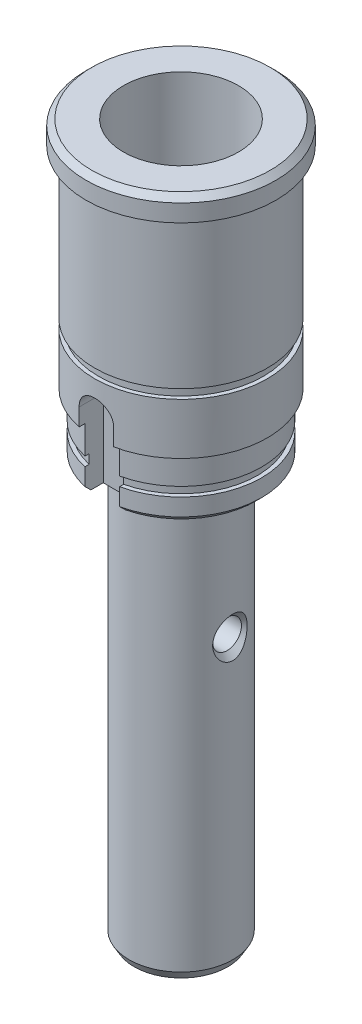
ISO-10303-21;
HEADER;
FILE_DESCRIPTION(('STEP AP214'),'2;1');
FILE_NAME('part.step','',(''),(''),'','','');
FILE_SCHEMA(('AUTOMOTIVE_DESIGN { 1 0 10303 214 1 1 1 1 }'));
ENDSEC;
DATA;
#1=APPLICATION_CONTEXT('core data for automotive mechanical design processes');
#2=APPLICATION_PROTOCOL_DEFINITION('international standard','automotive_design',2000,#1);
#3=PRODUCT_CONTEXT('',#1,'mechanical');
#4=PRODUCT('Part','Part','',(#3));
#5=PRODUCT_RELATED_PRODUCT_CATEGORY('part','',(#4));
#6=PRODUCT_DEFINITION_FORMATION('','',#4);
#7=PRODUCT_DEFINITION_CONTEXT('part definition',#1,'design');
#8=PRODUCT_DEFINITION('design','',#6,#7);
#9=PRODUCT_DEFINITION_SHAPE('','',#8);
#10=(LENGTH_UNIT() NAMED_UNIT(*) SI_UNIT(.MILLI.,.METRE.));
#11=(NAMED_UNIT(*) PLANE_ANGLE_UNIT() SI_UNIT($,.RADIAN.));
#12=(NAMED_UNIT(*) SI_UNIT($,.STERADIAN.) SOLID_ANGLE_UNIT());
#13=UNCERTAINTY_MEASURE_WITH_UNIT(LENGTH_MEASURE(1.E-05),#10,'distance_accuracy_value','');
#14=(GEOMETRIC_REPRESENTATION_CONTEXT(3) GLOBAL_UNCERTAINTY_ASSIGNED_CONTEXT((#13)) GLOBAL_UNIT_ASSIGNED_CONTEXT((#10,
#11,#12)) REPRESENTATION_CONTEXT('',''));
#15=CARTESIAN_POINT('',(0.,0.,0.));
#16=DIRECTION('',(0.,0.,1.));
#17=DIRECTION('',(1.,0.,0.));
#18=AXIS2_PLACEMENT_3D('',#15,#16,#17);
#19=CARTESIAN_POINT('',(14.,-51.,0.));
#20=DIRECTION('',(0.,1.,0.));
#21=DIRECTION('',(0.,0.,1.));
#22=AXIS2_PLACEMENT_3D('',#19,#20,#21);
#23=PLANE('',#22);
#24=CARTESIAN_POINT('',(0.,-51.,0.));
#25=DIRECTION('',(0.,1.,0.));
#26=DIRECTION('',(0.,0.,1.));
#27=AXIS2_PLACEMENT_3D('',#24,#25,#26);
#28=CIRCLE('',#27,10.);
#29=CARTESIAN_POINT('',(0.,-51.,10.));
#30=VERTEX_POINT('',#29);
#31=EDGE_CURVE('E237',#30,#30,#28,.T.);
#32=ORIENTED_EDGE('',*,*,#31,.T.);
#33=EDGE_LOOP('',(#32));
#34=FACE_BOUND('',#33,.T.);
#35=DIRECTION('',(0.,0.,-1.));
#36=VECTOR('',#35,1.);
#37=CARTESIAN_POINT('',(-3.,-51.,0.));
#38=LINE('',#37,#36);
#39=CARTESIAN_POINT('',(-3.,-51.,12.6491106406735));
#40=VERTEX_POINT('',#39);
#41=CARTESIAN_POINT('',(-3.,-51.,10.5));
#42=VERTEX_POINT('',#41);
#43=EDGE_CURVE('E176',#40,#42,#38,.T.);
#44=ORIENTED_EDGE('',*,*,#43,.F.);
#45=CARTESIAN_POINT('',(0.,-51.,0.));
#46=DIRECTION('',(0.,1.,0.));
#47=DIRECTION('',(0.,0.,1.));
#48=AXIS2_PLACEMENT_3D('',#45,#46,#47);
#49=CIRCLE('',#48,13.);
#50=CARTESIAN_POINT('',(3.,-51.,12.6491106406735));
#51=VERTEX_POINT('',#50);
#52=EDGE_CURVE('E234',#40,#51,#49,.F.);
#53=ORIENTED_EDGE('',*,*,#52,.T.);
#54=DIRECTION('',(0.,0.,1.));
#55=VECTOR('',#54,1.);
#56=CARTESIAN_POINT('',(3.,-51.,0.));
#57=LINE('',#56,#55);
#58=CARTESIAN_POINT('',(3.,-51.,10.5));
#59=VERTEX_POINT('',#58);
#60=EDGE_CURVE('E54',#59,#51,#57,.T.);
#61=ORIENTED_EDGE('',*,*,#60,.F.);
#62=DIRECTION('',(1.,0.,0.));
#63=VECTOR('',#62,1.);
#64=CARTESIAN_POINT('',(14.,-51.,10.5));
#65=LINE('',#64,#63);
#66=EDGE_CURVE('E11',#42,#59,#65,.T.);
#67=ORIENTED_EDGE('',*,*,#66,.F.);
#68=EDGE_LOOP('',(#44,#53,#61,#67));
#69=FACE_BOUND('',#68,.T.);
#70=ADVANCED_FACE('F34',(#34,#69),#23,.F.);
#71=CARTESIAN_POINT('',(0.,9.98599402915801,0.));
#72=DIRECTION('',(0.,1.,0.));
#73=DIRECTION('',(0.,0.,1.));
#74=AXIS2_PLACEMENT_3D('',#71,#72,#73);
#75=CYLINDRICAL_SURFACE('',#74,14.);
#76=DIRECTION('',(0.,1.,0.));
#77=VECTOR('',#76,1.);
#78=CARTESIAN_POINT('',(-2.99999999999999,9.98599402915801,13.6747943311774));
#79=LINE('',#78,#77);
#80=CARTESIAN_POINT('',(-2.99999999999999,-47.,13.6747943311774));
#81=VERTEX_POINT('',#80);
#82=CARTESIAN_POINT('',(-3.,-50.,13.6747943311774));
#83=VERTEX_POINT('',#82);
#84=EDGE_CURVE('E174',#81,#83,#79,.F.);
#85=ORIENTED_EDGE('',*,*,#84,.F.);
#86=CARTESIAN_POINT('',(0.,-47.,0.));
#87=DIRECTION('',(0.,1.,0.));
#88=DIRECTION('',(0.,0.,1.));
#89=AXIS2_PLACEMENT_3D('',#86,#87,#88);
#90=CIRCLE('',#89,14.);
#91=CARTESIAN_POINT('',(3.,-47.,13.6747943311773));
#92=VERTEX_POINT('',#91);
#93=EDGE_CURVE('E219',#92,#81,#90,.T.);
#94=ORIENTED_EDGE('',*,*,#93,.F.);
#95=DIRECTION('',(0.,1.,0.));
#96=VECTOR('',#95,1.);
#97=CARTESIAN_POINT('',(3.,9.98599402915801,13.6747943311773));
#98=LINE('',#97,#96);
#99=CARTESIAN_POINT('',(3.,-50.,13.6747943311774));
#100=VERTEX_POINT('',#99);
#101=EDGE_CURVE('E159',#100,#92,#98,.T.);
#102=ORIENTED_EDGE('',*,*,#101,.F.);
#103=CARTESIAN_POINT('',(0.,-50.,0.));
#104=DIRECTION('',(0.,1.,0.));
#105=DIRECTION('',(0.,0.,1.));
#106=AXIS2_PLACEMENT_3D('',#103,#104,#105);
#107=CIRCLE('',#106,14.);
#108=EDGE_CURVE('E249',#100,#83,#107,.T.);
#109=ORIENTED_EDGE('',*,*,#108,.T.);
#110=EDGE_LOOP('',(#85,#94,#102,#109));
#111=FACE_BOUND('',#110,.T.);
#112=ADVANCED_FACE('F313',(#111),#75,.T.);
#113=CARTESIAN_POINT('',(14.,-47.,0.));
#114=DIRECTION('',(0.,-1.,0.));
#115=DIRECTION('',(0.,0.,-1.));
#116=AXIS2_PLACEMENT_3D('',#113,#114,#115);
#117=PLANE('',#116);
#118=DIRECTION('',(0.,0.,1.));
#119=VECTOR('',#118,1.);
#120=CARTESIAN_POINT('',(-3.,-47.,0.));
#121=LINE('',#120,#119);
#122=CARTESIAN_POINT('',(-3.,-47.,12.9572373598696));
#123=VERTEX_POINT('',#122);
#124=EDGE_CURVE('E178',#123,#81,#121,.T.);
#125=ORIENTED_EDGE('',*,*,#124,.F.);
#126=CARTESIAN_POINT('',(0.,-47.,0.));
#127=DIRECTION('',(0.,1.,0.));
#128=DIRECTION('',(0.,0.,1.));
#129=AXIS2_PLACEMENT_3D('',#126,#127,#128);
#130=CIRCLE('',#129,13.3);
#131=CARTESIAN_POINT('',(3.,-47.,12.9572373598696));
#132=VERTEX_POINT('',#131);
#133=EDGE_CURVE('E216',#132,#123,#130,.T.);
#134=ORIENTED_EDGE('',*,*,#133,.F.);
#135=DIRECTION('',(0.,0.,-1.));
#136=VECTOR('',#135,1.);
#137=CARTESIAN_POINT('',(3.,-47.,0.));
#138=LINE('',#137,#136);
#139=EDGE_CURVE('E162',#92,#132,#138,.T.);
#140=ORIENTED_EDGE('',*,*,#139,.F.);
#141=ORIENTED_EDGE('',*,*,#93,.T.);
#142=EDGE_LOOP('',(#125,#134,#140,#141));
#143=FACE_BOUND('',#142,.T.);
#144=ADVANCED_FACE('F309',(#143),#117,.F.);
#145=CARTESIAN_POINT('',(0.,9.98599402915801,0.));
#146=DIRECTION('',(0.,1.,0.));
#147=DIRECTION('',(0.,0.,1.));
#148=AXIS2_PLACEMENT_3D('',#145,#146,#147);
#149=CYLINDRICAL_SURFACE('',#148,13.3);
#150=DIRECTION('',(0.,1.,0.));
#151=VECTOR('',#150,1.);
#152=CARTESIAN_POINT('',(-2.99999999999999,9.98599402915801,12.9572373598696));
#153=LINE('',#152,#151);
#154=CARTESIAN_POINT('',(-2.99999999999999,-45.4,12.9572373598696));
#155=VERTEX_POINT('',#154);
#156=EDGE_CURVE('E180',#155,#123,#153,.F.);
#157=ORIENTED_EDGE('',*,*,#156,.F.);
#158=CARTESIAN_POINT('',(0.,-45.4,0.));
#159=DIRECTION('',(0.,1.,0.));
#160=DIRECTION('',(0.,0.,1.));
#161=AXIS2_PLACEMENT_3D('',#158,#159,#160);
#162=CIRCLE('',#161,13.3);
#163=CARTESIAN_POINT('',(3.,-45.4,12.9572373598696));
#164=VERTEX_POINT('',#163);
#165=EDGE_CURVE('E213',#164,#155,#162,.T.);
#166=ORIENTED_EDGE('',*,*,#165,.F.);
#167=DIRECTION('',(0.,1.,0.));
#168=VECTOR('',#167,1.);
#169=CARTESIAN_POINT('',(3.,9.98599402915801,12.9572373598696));
#170=LINE('',#169,#168);
#171=EDGE_CURVE('E164',#132,#164,#170,.T.);
#172=ORIENTED_EDGE('',*,*,#171,.F.);
#173=ORIENTED_EDGE('',*,*,#133,.T.);
#174=EDGE_LOOP('',(#157,#166,#172,#173));
#175=FACE_BOUND('',#174,.T.);
#176=ADVANCED_FACE('F305',(#175),#149,.T.);
#177=CARTESIAN_POINT('',(13.3,-45.4,0.));
#178=DIRECTION('',(0.,1.,0.));
#179=DIRECTION('',(0.,0.,1.));
#180=AXIS2_PLACEMENT_3D('',#177,#178,#179);
#181=PLANE('',#180);
#182=DIRECTION('',(0.,0.,-1.));
#183=VECTOR('',#182,1.);
#184=CARTESIAN_POINT('',(-3.,-45.4,0.));
#185=LINE('',#184,#183);
#186=CARTESIAN_POINT('',(-3.,-45.4,13.6747943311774));
#187=VERTEX_POINT('',#186);
#188=EDGE_CURVE('E182',#187,#155,#185,.T.);
#189=ORIENTED_EDGE('',*,*,#188,.F.);
#190=CARTESIAN_POINT('',(0.,-45.4,0.));
#191=DIRECTION('',(0.,1.,0.));
#192=DIRECTION('',(0.,0.,1.));
#193=AXIS2_PLACEMENT_3D('',#190,#191,#192);
#194=CIRCLE('',#193,14.);
#195=CARTESIAN_POINT('',(3.,-45.4,13.6747943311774));
#196=VERTEX_POINT('',#195);
#197=EDGE_CURVE('E210',#196,#187,#194,.T.);
#198=ORIENTED_EDGE('',*,*,#197,.F.);
#199=DIRECTION('',(0.,0.,1.));
#200=VECTOR('',#199,1.);
#201=CARTESIAN_POINT('',(3.,-45.4,0.));
#202=LINE('',#201,#200);
#203=EDGE_CURVE('E166',#164,#196,#202,.T.);
#204=ORIENTED_EDGE('',*,*,#203,.F.);
#205=ORIENTED_EDGE('',*,*,#165,.T.);
#206=EDGE_LOOP('',(#189,#198,#204,#205));
#207=FACE_BOUND('',#206,.T.);
#208=ADVANCED_FACE('F301',(#207),#181,.F.);
#209=CARTESIAN_POINT('',(0.,9.98599402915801,0.));
#210=DIRECTION('',(0.,1.,0.));
#211=DIRECTION('',(0.,0.,1.));
#212=AXIS2_PLACEMENT_3D('',#209,#210,#211);
#213=CYLINDRICAL_SURFACE('',#212,14.);
#214=DIRECTION('',(0.,1.,0.));
#215=VECTOR('',#214,1.);
#216=CARTESIAN_POINT('',(-2.99999999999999,9.98599402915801,13.6747943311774));
#217=LINE('',#216,#215);
#218=CARTESIAN_POINT('',(-2.99999999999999,-40.5,13.6747943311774));
#219=VERTEX_POINT('',#218);
#220=EDGE_CURVE('E184',#219,#187,#217,.F.);
#221=ORIENTED_EDGE('',*,*,#220,.F.);
#222=CARTESIAN_POINT('',(0.,-40.5,0.));
#223=DIRECTION('',(0.,1.,0.));
#224=DIRECTION('',(0.,0.,1.));
#225=AXIS2_PLACEMENT_3D('',#222,#223,#224);
#226=CIRCLE('',#225,14.);
#227=CARTESIAN_POINT('',(3.,-40.5,13.6747943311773));
#228=VERTEX_POINT('',#227);
#229=EDGE_CURVE('E207',#228,#219,#226,.T.);
#230=ORIENTED_EDGE('',*,*,#229,.F.);
#231=DIRECTION('',(0.,1.,0.));
#232=VECTOR('',#231,1.);
#233=CARTESIAN_POINT('',(3.,9.98599402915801,13.6747943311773));
#234=LINE('',#233,#232);
#235=EDGE_CURVE('E168',#196,#228,#234,.T.);
#236=ORIENTED_EDGE('',*,*,#235,.F.);
#237=ORIENTED_EDGE('',*,*,#197,.T.);
#238=EDGE_LOOP('',(#221,#230,#236,#237));
#239=FACE_BOUND('',#238,.T.);
#240=ADVANCED_FACE('F297',(#239),#213,.T.);
#241=CARTESIAN_POINT('',(15.,-40.5,0.));
#242=DIRECTION('',(0.,1.,0.));
#243=DIRECTION('',(0.,0.,1.));
#244=AXIS2_PLACEMENT_3D('',#241,#242,#243);
#245=PLANE('',#244);
#246=DIRECTION('',(0.,0.,-1.));
#247=VECTOR('',#246,1.);
#248=CARTESIAN_POINT('',(-3.,-40.5,0.));
#249=LINE('',#248,#247);
#250=CARTESIAN_POINT('',(-3.,-40.5,14.6969384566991));
#251=VERTEX_POINT('',#250);
#252=EDGE_CURVE('E186',#251,#219,#249,.T.);
#253=ORIENTED_EDGE('',*,*,#252,.F.);
#254=CARTESIAN_POINT('',(0.,-40.5,0.));
#255=DIRECTION('',(0.,1.,0.));
#256=DIRECTION('',(0.,0.,1.));
#257=AXIS2_PLACEMENT_3D('',#254,#255,#256);
#258=CIRCLE('',#257,15.);
#259=CARTESIAN_POINT('',(3.,-40.5,14.6969384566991));
#260=VERTEX_POINT('',#259);
#261=EDGE_CURVE('E204',#260,#251,#258,.T.);
#262=ORIENTED_EDGE('',*,*,#261,.F.);
#263=DIRECTION('',(0.,0.,1.));
#264=VECTOR('',#263,1.);
#265=CARTESIAN_POINT('',(3.,-40.5,0.));
#266=LINE('',#265,#264);
#267=EDGE_CURVE('E170',#228,#260,#266,.T.);
#268=ORIENTED_EDGE('',*,*,#267,.F.);
#269=ORIENTED_EDGE('',*,*,#229,.T.);
#270=EDGE_LOOP('',(#253,#262,#268,#269));
#271=FACE_BOUND('',#270,.T.);
#272=ADVANCED_FACE('F291',(#271),#245,.F.);
#273=CARTESIAN_POINT('',(0.,9.98599402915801,0.));
#274=DIRECTION('',(0.,1.,0.));
#275=DIRECTION('',(0.,0.,1.));
#276=AXIS2_PLACEMENT_3D('',#273,#274,#275);
#277=CYLINDRICAL_SURFACE('',#276,15.);
#278=CARTESIAN_POINT('',(0.,-31.6,0.));
#279=DIRECTION('',(0.,1.,0.));
#280=DIRECTION('',(0.,0.,1.));
#281=AXIS2_PLACEMENT_3D('',#278,#279,#280);
#282=CIRCLE('',#281,15.);
#283=CARTESIAN_POINT('',(0.,-31.6,15.));
#284=VERTEX_POINT('',#283);
#285=EDGE_CURVE('E201',#284,#284,#282,.T.);
#286=ORIENTED_EDGE('',*,*,#285,.F.);
#287=EDGE_LOOP('',(#286));
#288=FACE_BOUND('',#287,.T.);
#289=DIRECTION('',(0.,1.,0.));
#290=VECTOR('',#289,1.);
#291=CARTESIAN_POINT('',(-2.99999999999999,9.98599402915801,14.6969384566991));
#292=LINE('',#291,#290);
#293=CARTESIAN_POINT('',(-3.,-37.5,14.6969384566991));
#294=VERTEX_POINT('',#293);
#295=EDGE_CURVE('E62',#294,#251,#292,.F.);
#296=ORIENTED_EDGE('',*,*,#295,.F.);
#297=CARTESIAN_POINT('',(3.,-37.5,14.6969384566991));
#298=CARTESIAN_POINT('',(3.0000090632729,-37.4165231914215,14.6969312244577));
#299=CARTESIAN_POINT('',(2.99651591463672,-37.3330513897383,14.6976495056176));
#300=CARTESIAN_POINT('',(2.98259549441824,-37.1667219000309,14.7004835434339));
#301=CARTESIAN_POINT('',(2.97216908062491,-37.0838641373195,14.7025991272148));
#302=CARTESIAN_POINT('',(2.94447346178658,-36.9194709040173,14.708170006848));
#303=CARTESIAN_POINT('',(2.92721468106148,-36.8379336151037,14.7116232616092));
#304=CARTESIAN_POINT('',(2.88600721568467,-36.6766535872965,14.7197622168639));
#305=CARTESIAN_POINT('',(2.86205850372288,-36.5969108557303,14.7244479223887));
#306=CARTESIAN_POINT('',(2.78041527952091,-36.361194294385,14.7401631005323));
#307=CARTESIAN_POINT('',(2.71290158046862,-36.2086019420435,14.7528553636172));
#308=CARTESIAN_POINT('',(2.55375565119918,-35.9169726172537,14.7812320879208));
#309=CARTESIAN_POINT('',(2.46212092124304,-35.7779370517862,14.7969168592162));
#310=CARTESIAN_POINT('',(2.25594334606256,-35.5153294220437,14.829758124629));
#311=CARTESIAN_POINT('',(2.14112719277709,-35.391973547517,14.8469306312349));
#312=CARTESIAN_POINT('',(1.89243128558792,-35.1661342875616,14.8806728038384));
#313=CARTESIAN_POINT('',(1.75854858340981,-35.0636541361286,14.8972423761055));
#314=CARTESIAN_POINT('',(1.47408029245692,-34.8816339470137,14.9280843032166));
#315=CARTESIAN_POINT('',(1.32335950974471,-34.8023012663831,14.9423354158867));
#316=CARTESIAN_POINT('',(1.01040357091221,-34.6701721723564,14.9667526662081));
#317=CARTESIAN_POINT('',(0.848170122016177,-34.6173718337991,14.9769194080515));
#318=CARTESIAN_POINT('',(0.519052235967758,-34.5404789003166,14.9919095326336));
#319=CARTESIAN_POINT('',(0.352257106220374,-34.5160176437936,14.996801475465));
#320=CARTESIAN_POINT('',(0.0168596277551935,-34.4953470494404,15.0009276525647));
#321=CARTESIAN_POINT('',(-0.151742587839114,-34.4991356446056,15.0001623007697));
#322=CARTESIAN_POINT('',(-0.483426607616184,-34.5345786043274,14.9931130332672));
#323=CARTESIAN_POINT('',(-0.646552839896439,-34.5658351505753,14.9869079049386));
#324=CARTESIAN_POINT('',(-0.965196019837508,-34.6546955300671,14.9697652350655));
#325=CARTESIAN_POINT('',(-1.12071271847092,-34.7123002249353,14.9588275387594));
#326=CARTESIAN_POINT('',(-1.42086081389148,-34.8525912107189,14.9333186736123));
#327=CARTESIAN_POINT('',(-1.56541718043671,-34.9354337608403,14.918724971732));
#328=CARTESIAN_POINT('',(-1.83871931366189,-35.1237308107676,14.8875135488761));
#329=CARTESIAN_POINT('',(-1.96746376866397,-35.2291871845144,14.8708956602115));
#330=CARTESIAN_POINT('',(-2.20783861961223,-35.4618850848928,14.8371311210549));
#331=CARTESIAN_POINT('',(-2.31913408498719,-35.5894722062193,14.8199802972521));
#332=CARTESIAN_POINT('',(-2.51883269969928,-35.861714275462,14.7873511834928));
#333=CARTESIAN_POINT('',(-2.60722950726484,-36.0063739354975,14.7718733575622));
#334=CARTESIAN_POINT('',(-2.75873986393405,-36.309157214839,14.7443319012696));
#335=CARTESIAN_POINT('',(-2.82178462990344,-36.46731607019,14.7322775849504));
#336=CARTESIAN_POINT('',(-2.9202212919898,-36.7921758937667,14.7130848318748));
#337=CARTESIAN_POINT('',(-2.95565438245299,-36.9588637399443,14.7059390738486));
#338=CARTESIAN_POINT('',(-2.9844988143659,-37.1890704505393,14.7000953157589));
#339=CARTESIAN_POINT('',(-2.99031376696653,-37.2511624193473,14.6989127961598));
#340=CARTESIAN_POINT('',(-2.99805949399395,-37.3754935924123,14.6973350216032));
#341=CARTESIAN_POINT('',(-2.99999676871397,-37.4377323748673,14.6969384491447));
#342=CARTESIAN_POINT('',(-3.,-37.5,14.6969384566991));
#343=B_SPLINE_CURVE_WITH_KNOTS('',3,(#297,#298,#299,#300,#301,#302,#303,#304,#305,#306,#307,
#308,#309,#310,#311,#312,#313,#314,#315,#316,#317,#318,#319,#320,#321,#322,#323,#324,#325,#326,
#327,#328,#329,#330,#331,#332,#333,#334,#335,#336,#337,#338,#339,#340,#341,#342),.UNSPECIFIED.,
.F.,.F.,(4,2,2,2,2,2,2,2,2,2,2,2,2,2,2,2,2,2,2,2,2,2,4),(0.,0.250345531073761,0.500660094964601,
0.750594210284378,1.00052934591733,1.5000082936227,1.99953902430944,2.50534477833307,
3.01122883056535,3.52151451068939,4.03172467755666,4.5352202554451,5.03867899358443,
5.53496413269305,6.03126550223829,6.53070440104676,7.03018470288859,7.53831354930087,
8.04658297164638,8.5562222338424,9.06509969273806,9.25212746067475,9.43884144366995),.UNSPECIFIED.);
#344=CARTESIAN_POINT('',(3.,-37.5,14.6969384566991));
#345=VERTEX_POINT('',#344);
#346=EDGE_CURVE('E46',#345,#294,#343,.T.);
#347=ORIENTED_EDGE('',*,*,#346,.F.);
#348=DIRECTION('',(0.,1.,0.));
#349=VECTOR('',#348,1.);
#350=CARTESIAN_POINT('',(3.,9.98599402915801,14.6969384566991));
#351=LINE('',#350,#349);
#352=EDGE_CURVE('E172',#260,#345,#351,.T.);
#353=ORIENTED_EDGE('',*,*,#352,.F.);
#354=ORIENTED_EDGE('',*,*,#261,.T.);
#355=EDGE_LOOP('',(#296,#347,#353,#354));
#356=FACE_BOUND('',#355,.T.);
#357=ADVANCED_FACE('F286',(#288,#356),#277,.T.);
#358=CARTESIAN_POINT('',(0.,-50.,0.));
#359=DIRECTION('',(0.,1.,0.));
#360=DIRECTION('',(0.,0.,1.));
#361=AXIS2_PLACEMENT_3D('',#358,#359,#360);
#362=CONICAL_SURFACE('',#361,14.,0.785398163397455);
#363=ORIENTED_EDGE('',*,*,#52,.F.);
#364=CARTESIAN_POINT('',(-3.,-55.5667533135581,7.88160197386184));
#365=CARTESIAN_POINT('',(-3.,-55.3682053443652,8.09402792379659));
#366=CARTESIAN_POINT('',(-3.,-55.1691349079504,8.30596402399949));
#367=CARTESIAN_POINT('',(-3.,-54.7701226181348,8.72901231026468));
#368=CARTESIAN_POINT('',(-3.,-54.5701807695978,8.94012450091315));
#369=CARTESIAN_POINT('',(-3.,-54.1696004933,9.36167939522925));
#370=CARTESIAN_POINT('',(-3.,-53.968962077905,9.57212211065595));
#371=CARTESIAN_POINT('',(-3.,-53.5671042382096,9.99245255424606));
#372=CARTESIAN_POINT('',(-3.,-53.365884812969,10.2023402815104));
#373=CARTESIAN_POINT('',(-3.,-52.7615206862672,10.8312950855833));
#374=CARTESIAN_POINT('',(-3.,-52.3576551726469,11.2496694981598));
#375=CARTESIAN_POINT('',(-3.,-51.5485492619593,12.085089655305));
#376=CARTESIAN_POINT('',(-3.,-51.1433088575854,12.5021353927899));
#377=CARTESIAN_POINT('',(-3.,-50.3318216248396,13.3352155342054));
#378=CARTESIAN_POINT('',(-3.,-49.9255748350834,13.7512499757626));
#379=CARTESIAN_POINT('',(-3.,-49.1123018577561,14.582556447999));
#380=CARTESIAN_POINT('',(-3.,-48.7052756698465,14.997828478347));
#381=CARTESIAN_POINT('',(-3.,-47.8906034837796,15.8277908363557));
#382=CARTESIAN_POINT('',(-3.,-47.4829574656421,16.242481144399));
#383=CARTESIAN_POINT('',(-3.,-46.667176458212,17.0713813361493));
#384=CARTESIAN_POINT('',(-3.,-46.2590414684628,17.4855912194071));
#385=CARTESIAN_POINT('',(-3.,-45.8507211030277,17.8996179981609));
#386=B_SPLINE_CURVE_WITH_KNOTS('',3,(#364,#365,#366,#367,#368,#369,#370,#371,#372,#373,#374,
#375,#376,#377,#378,#379,#380,#381,#382,#383,#384,#385),.UNSPECIFIED.,.F.,.F.,(4,2,2,2,2,2,2,2,
2,2,4),(0.,0.872301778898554,1.74459869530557,2.61688020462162,3.48916312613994,
5.23366387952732,6.97817391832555,8.72261802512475,10.4670628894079,12.2115652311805,
13.9560692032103),.UNSPECIFIED.);
#387=EDGE_CURVE('E259',#40,#83,#386,.T.);
#388=ORIENTED_EDGE('',*,*,#387,.T.);
#389=ORIENTED_EDGE('',*,*,#108,.F.);
#390=CARTESIAN_POINT('',(3.,-45.8507211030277,17.8996179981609));
#391=CARTESIAN_POINT('',(3.,-46.2590414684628,17.4855912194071));
#392=CARTESIAN_POINT('',(3.,-46.667176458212,17.0713813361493));
#393=CARTESIAN_POINT('',(3.,-47.4829574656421,16.242481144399));
#394=CARTESIAN_POINT('',(3.,-47.8906034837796,15.8277908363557));
#395=CARTESIAN_POINT('',(3.,-48.7052756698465,14.997828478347));
#396=CARTESIAN_POINT('',(3.,-49.1123018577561,14.582556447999));
#397=CARTESIAN_POINT('',(3.,-49.9255748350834,13.7512499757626));
#398=CARTESIAN_POINT('',(3.,-50.3318216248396,13.3352155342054));
#399=CARTESIAN_POINT('',(3.,-51.1433088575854,12.5021353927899));
#400=CARTESIAN_POINT('',(3.,-51.5485492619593,12.085089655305));
#401=CARTESIAN_POINT('',(3.,-52.3576551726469,11.2496694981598));
#402=CARTESIAN_POINT('',(3.,-52.7615206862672,10.8312950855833));
#403=CARTESIAN_POINT('',(3.,-53.365884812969,10.2023402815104));
#404=CARTESIAN_POINT('',(3.,-53.5671042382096,9.99245255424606));
#405=CARTESIAN_POINT('',(3.,-53.968962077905,9.57212211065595));
#406=CARTESIAN_POINT('',(3.,-54.1696004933,9.36167939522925));
#407=CARTESIAN_POINT('',(3.,-54.5701807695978,8.94012450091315));
#408=CARTESIAN_POINT('',(3.,-54.7701226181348,8.72901231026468));
#409=CARTESIAN_POINT('',(3.,-55.1691349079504,8.3059640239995));
#410=CARTESIAN_POINT('',(3.,-55.3682053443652,8.0940279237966));
#411=CARTESIAN_POINT('',(3.,-55.5667533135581,7.88160197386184));
#412=B_SPLINE_CURVE_WITH_KNOTS('',3,(#390,#391,#392,#393,#394,#395,#396,#397,#398,#399,#400,
#401,#402,#403,#404,#405,#406,#407,#408,#409,#410,#411),.UNSPECIFIED.,.F.,.F.,(4,2,2,2,2,2,2,2,
2,2,4),(0.,1.7445039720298,3.48900631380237,5.23345117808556,6.97789528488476,8.72240532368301,
10.4669060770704,11.3391889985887,12.2114705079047,13.0837674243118,13.9560692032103),.UNSPECIFIED.);
#413=EDGE_CURVE('E252',#100,#51,#412,.T.);
#414=ORIENTED_EDGE('',*,*,#413,.T.);
#415=EDGE_LOOP('',(#363,#388,#389,#414));
#416=FACE_BOUND('',#415,.T.);
#417=ADVANCED_FACE('F265',(#416),#362,.T.);
#418=CARTESIAN_POINT('',(9.00000000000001,-123.5,0.));
#419=DIRECTION('',(0.,1.,0.));
#420=DIRECTION('',(0.,0.,1.));
#421=AXIS2_PLACEMENT_3D('',#418,#419,#420);
#422=PLANE('',#421);
#423=CARTESIAN_POINT('',(0.,-123.5,0.));
#424=DIRECTION('',(0.,1.,0.));
#425=DIRECTION('',(0.,0.,1.));
#426=AXIS2_PLACEMENT_3D('',#423,#424,#425);
#427=CIRCLE('',#426,8.13397459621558);
#428=CARTESIAN_POINT('',(0.,-123.5,8.13397459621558));
#429=VERTEX_POINT('',#428);
#430=EDGE_CURVE('E231',#429,#429,#427,.F.);
#431=ORIENTED_EDGE('',*,*,#430,.T.);
#432=EDGE_LOOP('',(#431));
#433=FACE_BOUND('',#432,.T.);
#434=ADVANCED_FACE('F36',(#433),#422,.F.);
#435=CARTESIAN_POINT('',(0.,9.98599402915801,0.));
#436=DIRECTION('',(0.,1.,0.));
#437=DIRECTION('',(0.,0.,1.));
#438=AXIS2_PLACEMENT_3D('',#435,#436,#437);
#439=CYLINDRICAL_SURFACE('',#438,9.00000000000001);
#440=CARTESIAN_POINT('',(-8.61271600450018,-75.193480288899,-2.61172828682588));
#441=CARTESIAN_POINT('',(-8.58526522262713,-75.0033823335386,-2.70226424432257));
#442=CARTESIAN_POINT('',(-8.56107579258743,-74.8049321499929,-2.77700005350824));
#443=CARTESIAN_POINT('',(-8.52232226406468,-74.3973896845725,-2.89375924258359));
#444=CARTESIAN_POINT('',(-8.5077827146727,-74.1882717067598,-2.9356992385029));
#445=CARTESIAN_POINT('',(-8.49024477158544,-73.7652858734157,-2.98604557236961));
#446=CARTESIAN_POINT('',(-8.48725868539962,-73.5514131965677,-2.99441615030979));
#447=CARTESIAN_POINT('',(-8.4932571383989,-73.1253421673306,-2.97735765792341));
#448=CARTESIAN_POINT('',(-8.50223394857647,-72.9131428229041,-2.9519504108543));
#449=CARTESIAN_POINT('',(-8.53106344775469,-72.495034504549,-2.86756672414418));
#450=CARTESIAN_POINT('',(-8.55097704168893,-72.2891676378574,-2.80840222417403));
#451=CARTESIAN_POINT('',(-8.59919239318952,-71.8907444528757,-2.65709759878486));
#452=CARTESIAN_POINT('',(-8.62750064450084,-71.6981985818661,-2.56493193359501));
#453=CARTESIAN_POINT('',(-8.68858750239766,-71.3344496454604,-2.34964765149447));
#454=CARTESIAN_POINT('',(-8.7213217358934,-71.1630635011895,-2.22682715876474));
#455=CARTESIAN_POINT('',(-8.78708967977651,-70.8465568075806,-1.95115442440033));
#456=CARTESIAN_POINT('',(-8.82012276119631,-70.7013905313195,-1.79835545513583));
#457=CARTESIAN_POINT('',(-8.87323202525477,-70.4799477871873,-1.51031150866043));
#458=CARTESIAN_POINT('',(-8.89440226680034,-70.3956463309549,-1.38141514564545));
#459=CARTESIAN_POINT('',(-8.93219931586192,-70.249024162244,-1.11102865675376));
#460=CARTESIAN_POINT('',(-8.94882983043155,-70.1866855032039,-0.969548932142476));
#461=CARTESIAN_POINT('',(-8.97576492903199,-70.0871632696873,-0.676325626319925));
#462=CARTESIAN_POINT('',(-8.98602921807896,-70.0501397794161,-0.524523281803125));
#463=CARTESIAN_POINT('',(-8.99871612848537,-70.004521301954,-0.216378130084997));
#464=CARTESIAN_POINT('',(-9.001142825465,-69.9959115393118,-0.0600377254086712));
#465=CARTESIAN_POINT('',(-8.99801479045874,-70.0070969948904,0.234912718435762));
#466=CARTESIAN_POINT('',(-8.99327583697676,-70.0239886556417,0.373651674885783));
#467=CARTESIAN_POINT('',(-8.97780897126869,-70.079931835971,0.646206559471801));
#468=CARTESIAN_POINT('',(-8.96708077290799,-70.1189844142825,0.780022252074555));
#469=CARTESIAN_POINT('',(-8.94064248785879,-70.2174435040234,1.04026580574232));
#470=CARTESIAN_POINT('',(-8.92490272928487,-70.2769714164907,1.16664421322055));
#471=CARTESIAN_POINT('',(-8.88988504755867,-70.4136707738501,1.40888223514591));
#472=CARTESIAN_POINT('',(-8.87060588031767,-70.4908484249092,1.52473812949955));
#473=CARTESIAN_POINT('',(-8.8273906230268,-70.6711433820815,1.75872525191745));
#474=CARTESIAN_POINT('',(-8.80317476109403,-70.7763252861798,1.8752095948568));
#475=CARTESIAN_POINT('',(-8.75424850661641,-71.0022848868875,2.09176509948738));
#476=CARTESIAN_POINT('',(-8.72953781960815,-71.1230721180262,2.19182614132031));
#477=CARTESIAN_POINT('',(-8.67746304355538,-71.3987858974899,2.39037690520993));
#478=CARTESIAN_POINT('',(-8.6503592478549,-71.556028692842,2.48572488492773));
#479=CARTESIAN_POINT('',(-8.60074831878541,-71.8834856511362,2.6522988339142));
#480=CARTESIAN_POINT('',(-8.57824360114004,-72.0537065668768,2.72351213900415));
#481=CARTESIAN_POINT('',(-8.5377212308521,-72.4240571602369,2.84818535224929));
#482=CARTESIAN_POINT('',(-8.52055469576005,-72.6253371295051,2.89852955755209));
#483=CARTESIAN_POINT('',(-8.49677475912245,-73.0338588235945,2.96751666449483));
#484=CARTESIAN_POINT('',(-8.4901627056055,-73.241101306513,2.9861555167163));
#485=CARTESIAN_POINT('',(-8.48827803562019,-73.6627457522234,2.99151554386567));
#486=CARTESIAN_POINT('',(-8.49337675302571,-73.8771637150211,2.97719147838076));
#487=CARTESIAN_POINT('',(-8.51502771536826,-74.3004384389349,2.91468236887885));
#488=CARTESIAN_POINT('',(-8.53158176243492,-74.5092943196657,2.8664919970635));
#489=CARTESIAN_POINT('',(-8.57402709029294,-74.9156415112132,2.73691283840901));
#490=CARTESIAN_POINT('',(-8.59992565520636,-75.113123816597,2.65549814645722));
#491=CARTESIAN_POINT('',(-8.65778339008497,-75.4906858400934,2.46030858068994));
#492=CARTESIAN_POINT('',(-8.68974608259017,-75.6707553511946,2.34651487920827));
#493=CARTESIAN_POINT('',(-8.75461061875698,-76.0020737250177,2.09132612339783));
#494=CARTESIAN_POINT('',(-8.78746249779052,-76.1539787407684,1.95077573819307));
#495=CARTESIAN_POINT('',(-8.85030153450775,-76.4272963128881,1.64217304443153));
#496=CARTESIAN_POINT('',(-8.8802953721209,-76.5487811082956,1.47418748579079));
#497=CARTESIAN_POINT('',(-8.92474794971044,-76.7225001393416,1.16840759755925));
#498=CARTESIAN_POINT('',(-8.94117502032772,-76.7845859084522,1.03646024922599));
#499=CARTESIAN_POINT('',(-8.96858203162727,-76.8865564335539,0.763707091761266));
#500=CARTESIAN_POINT('',(-8.97956665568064,-76.9264602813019,0.62290901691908));
#501=CARTESIAN_POINT('',(-8.99489549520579,-76.9818254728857,0.335584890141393));
#502=CARTESIAN_POINT('',(-8.99921252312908,-76.997186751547,0.189037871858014));
#503=CARTESIAN_POINT('',(-9.00058911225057,-77.0021047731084,-0.104532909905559));
#504=CARTESIAN_POINT('',(-8.99764903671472,-76.9916628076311,-0.251556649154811));
#505=CARTESIAN_POINT('',(-8.98530244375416,-76.947224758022,-0.531731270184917));
#506=CARTESIAN_POINT('',(-8.97633263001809,-76.9148182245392,-0.665159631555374));
#507=CARTESIAN_POINT('',(-8.95329611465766,-76.829908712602,-0.924938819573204));
#508=CARTESIAN_POINT('',(-8.9392289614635,-76.7774039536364,-1.05128901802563));
#509=CARTESIAN_POINT('',(-8.90635206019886,-76.651184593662,-1.30143051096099));
#510=CARTESIAN_POINT('',(-8.88731738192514,-76.5764301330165,-1.42466377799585));
#511=CARTESIAN_POINT('',(-8.84662052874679,-76.4100942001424,-1.65875092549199));
#512=CARTESIAN_POINT('',(-8.82495605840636,-76.3184979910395,-1.76959382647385));
#513=CARTESIAN_POINT('',(-8.77722080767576,-76.106036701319,-1.99386795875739));
#514=CARTESIAN_POINT('',(-8.75098701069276,-75.9828357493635,-2.10504464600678));
#515=CARTESIAN_POINT('',(-8.69958122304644,-75.7216474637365,-2.30830649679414));
#516=CARTESIAN_POINT('',(-8.67440798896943,-75.5836781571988,-2.40041454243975));
#517=CARTESIAN_POINT('',(-8.64417831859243,-75.3997932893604,-2.50574373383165));
#518=CARTESIAN_POINT('',(-8.63768685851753,-75.3591174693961,-2.5280170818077));
#519=CARTESIAN_POINT('',(-8.62498273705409,-75.2769232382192,-2.5710258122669));
#520=CARTESIAN_POINT('',(-8.61877005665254,-75.2354048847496,-2.59176129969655));
#521=CARTESIAN_POINT('',(-8.61271600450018,-75.193480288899,-2.61172828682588));
#522=B_SPLINE_CURVE_WITH_KNOTS('',3,(#440,#441,#442,#443,#444,#445,#446,#447,#448,#449,#450,
#451,#452,#453,#454,#455,#456,#457,#458,#459,#460,#461,#462,#463,#464,#465,#466,#467,#468,#469,
#470,#471,#472,#473,#474,#475,#476,#477,#478,#479,#480,#481,#482,#483,#484,#485,#486,#487,#488,
#489,#490,#491,#492,#493,#494,#495,#496,#497,#498,#499,#500,#501,#502,#503,#504,#505,#506,#507,
#508,#509,#510,#511,#512,#513,#514,#515,#516,#517,#518,#519,#520,#521),.UNSPECIFIED.,.T.,.F.,(4,
2,2,2,2,2,2,2,2,2,2,2,2,2,2,2,2,2,2,2,2,2,2,2,2,2,2,2,2,2,2,2,2,2,2,2,2,2,2,2,4),(0.,
0.636838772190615,1.2752915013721,1.91442416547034,2.55314409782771,3.19545754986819,
3.83826916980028,4.47505758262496,5.1107244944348,5.57525990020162,6.03941483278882,
6.50647842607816,6.97329910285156,7.39082348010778,7.80836780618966,8.22843174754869,
8.64864362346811,9.12325184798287,9.59815143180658,10.1535548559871,10.7092492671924,
11.3309847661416,11.9527996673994,12.59460256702,13.2365064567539,13.8789118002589,
14.5216914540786,15.1468027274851,15.7704151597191,16.2088511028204,16.6469091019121,
17.0867486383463,17.5265661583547,17.9375410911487,18.3485524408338,18.7830315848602,
19.217892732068,19.7200578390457,20.2216168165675,20.362076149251,20.5025258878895),.UNSPECIFIED.);
#523=CARTESIAN_POINT('',(-8.61271600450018,-75.193480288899,-2.61172828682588));
#524=VERTEX_POINT('',#523);
#525=EDGE_CURVE('E38',#524,#524,#522,.T.);
#526=ORIENTED_EDGE('',*,*,#525,.T.);
#527=EDGE_LOOP('',(#526));
#528=FACE_BOUND('',#527,.T.);
#529=CARTESIAN_POINT('',(8.61271600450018,-75.193480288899,-2.61172828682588));
#530=CARTESIAN_POINT('',(8.63884786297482,-75.3743890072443,-2.52556295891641));
#531=CARTESIAN_POINT('',(8.66799271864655,-75.5482152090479,-2.42487715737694));
#532=CARTESIAN_POINT('',(8.72894107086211,-75.876043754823,-2.19537117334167));
#533=CARTESIAN_POINT('',(8.76074753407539,-76.0300234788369,-2.06651933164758));
#534=CARTESIAN_POINT('',(8.81726395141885,-76.2857372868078,-1.80830120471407));
#535=CARTESIAN_POINT('',(8.84220634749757,-76.3918747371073,-1.68335521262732));
#536=CARTESIAN_POINT('',(8.88873001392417,-76.5823706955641,-1.41727309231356));
#537=CARTESIAN_POINT('',(8.91031437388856,-76.6667492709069,-1.27615205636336));
#538=CARTESIAN_POINT('',(8.94783063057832,-76.8099394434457,-0.979209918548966));
#539=CARTESIAN_POINT('',(8.96371584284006,-76.8685407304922,-0.823280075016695));
#540=CARTESIAN_POINT('',(8.98739173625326,-76.9549598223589,-0.502516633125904));
#541=CARTESIAN_POINT('',(8.99519028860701,-76.9828075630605,-0.337691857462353));
#542=CARTESIAN_POINT('',(9.00110290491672,-77.0039441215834,-0.0282567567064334));
#543=CARTESIAN_POINT('',(9.00038874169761,-77.0014140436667,0.116057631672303));
#544=CARTESIAN_POINT('',(8.9921562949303,-76.9719182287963,0.401941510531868));
#545=CARTESIAN_POINT('',(8.9846389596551,-76.9449558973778,0.543511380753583));
#546=CARTESIAN_POINT('',(8.96409508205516,-76.8698781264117,0.814050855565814));
#547=CARTESIAN_POINT('',(8.95131001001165,-76.8226865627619,0.943299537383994));
#548=CARTESIAN_POINT('',(8.92148965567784,-76.7097205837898,1.19282595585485));
#549=CARTESIAN_POINT('',(8.90445330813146,-76.6439415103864,1.31310143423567));
#550=CARTESIAN_POINT('',(8.86567469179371,-76.4889312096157,1.55442202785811));
#551=CARTESIAN_POINT('',(8.8436313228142,-76.3980056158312,1.67432552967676));
#552=CARTESIAN_POINT('',(8.79799318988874,-76.2000379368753,1.89961971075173));
#553=CARTESIAN_POINT('',(8.77439755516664,-76.0929867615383,2.00500213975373));
#554=CARTESIAN_POINT('',(8.72350970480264,-75.8466364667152,2.21679002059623));
#555=CARTESIAN_POINT('',(8.69625948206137,-75.7049385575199,2.32041699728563));
#556=CARTESIAN_POINT('',(8.64460932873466,-75.4075240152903,2.50599667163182));
#557=CARTESIAN_POINT('',(8.62021111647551,-75.2517990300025,2.58793633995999));
#558=CARTESIAN_POINT('',(8.57331941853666,-74.9069652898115,2.73959867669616));
#559=CARTESIAN_POINT('',(8.55158777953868,-74.7162553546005,2.80593667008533));
#560=CARTESIAN_POINT('',(8.51715305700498,-74.3261767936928,2.90878871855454));
#561=CARTESIAN_POINT('',(8.50445203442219,-74.1268062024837,2.94529596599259));
#562=CARTESIAN_POINT('',(8.48915172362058,-73.713411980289,2.98913214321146));
#563=CARTESIAN_POINT('',(8.48714248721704,-73.4991830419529,2.99475727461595));
#564=CARTESIAN_POINT('',(8.49508829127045,-73.0727430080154,2.97213787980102));
#565=CARTESIAN_POINT('',(8.50504428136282,-72.8605320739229,2.94389066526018));
#566=CARTESIAN_POINT('',(8.53568755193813,-72.4433006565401,2.85382082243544));
#567=CARTESIAN_POINT('',(8.5564157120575,-72.2383107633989,2.79187024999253));
#568=CARTESIAN_POINT('',(8.6059941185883,-71.8421676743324,2.63507076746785));
#569=CARTESIAN_POINT('',(8.63484949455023,-71.6510233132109,2.54020107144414));
#570=CARTESIAN_POINT('',(8.69663656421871,-71.2908826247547,2.31979817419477));
#571=CARTESIAN_POINT('',(8.72952026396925,-71.1216670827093,2.1946114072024));
#572=CARTESIAN_POINT('',(8.79519466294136,-70.8100454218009,1.91444775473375));
#573=CARTESIAN_POINT('',(8.82798542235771,-70.6675909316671,1.75952566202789));
#574=CARTESIAN_POINT('',(8.88018396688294,-70.4519494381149,1.46893088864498));
#575=CARTESIAN_POINT('',(8.90079793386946,-70.3704760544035,1.33959981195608));
#576=CARTESIAN_POINT('',(8.93735027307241,-70.2295393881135,1.06881639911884));
#577=CARTESIAN_POINT('',(8.953292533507,-70.1700577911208,0.927374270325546));
#578=CARTESIAN_POINT('',(8.97879052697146,-70.0761744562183,0.634802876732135));
#579=CARTESIAN_POINT('',(8.98830726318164,-70.041925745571,0.483620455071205));
#580=CARTESIAN_POINT('',(8.99955651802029,-70.0015317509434,0.177255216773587));
#581=CARTESIAN_POINT('',(9.00129259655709,-69.995373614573,0.0220742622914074));
#582=CARTESIAN_POINT('',(8.99699279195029,-70.0107517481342,-0.270978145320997));
#583=CARTESIAN_POINT('',(8.99172454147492,-70.0295523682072,-0.409014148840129));
#584=CARTESIAN_POINT('',(8.97530887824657,-70.089034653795,-0.679889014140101));
#585=CARTESIAN_POINT('',(8.96416107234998,-70.1297177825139,-0.812727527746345));
#586=CARTESIAN_POINT('',(8.93692943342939,-70.2314501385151,-1.07167212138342));
#587=CARTESIAN_POINT('',(8.92078580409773,-70.2927469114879,-1.19767363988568));
#588=CARTESIAN_POINT('',(8.88506404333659,-70.4328701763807,-1.43893615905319));
#589=CARTESIAN_POINT('',(8.86548466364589,-70.5117030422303,-1.55419323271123));
#590=CARTESIAN_POINT('',(8.82168550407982,-70.6956856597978,-1.78709878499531));
#591=CARTESIAN_POINT('',(8.79719483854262,-70.8029405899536,-1.90302913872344));
#592=CARTESIAN_POINT('',(8.74788276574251,-71.0329729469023,-2.11819603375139));
#593=CARTESIAN_POINT('',(8.72306115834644,-71.1557601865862,-2.21742192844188));
#594=CARTESIAN_POINT('',(8.67095084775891,-71.4356718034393,-2.41384188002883));
#595=CARTESIAN_POINT('',(8.64395539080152,-71.5950907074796,-2.50785102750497));
#596=CARTESIAN_POINT('',(8.59482416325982,-71.9267070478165,-2.67138438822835));
#597=CARTESIAN_POINT('',(8.57269038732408,-72.0989096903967,-2.74089855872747));
#598=CARTESIAN_POINT('',(8.53328986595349,-72.472523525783,-2.8613775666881));
#599=CARTESIAN_POINT('',(8.5168753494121,-72.6750165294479,-2.90929059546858));
#600=CARTESIAN_POINT('',(8.4947694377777,-73.0856564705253,-2.97322091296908));
#601=CARTESIAN_POINT('',(8.48908480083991,-73.2938068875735,-2.98921810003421));
#602=CARTESIAN_POINT('',(8.48915688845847,-73.7163935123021,-2.98901826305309));
#603=CARTESIAN_POINT('',(8.49526558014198,-73.9308290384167,-2.9718308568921));
#604=CARTESIAN_POINT('',(8.51883340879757,-74.3532859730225,-2.90357854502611));
#605=CARTESIAN_POINT('',(8.53626927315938,-74.56131961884,-2.85258309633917));
#606=CARTESIAN_POINT('',(8.56619405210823,-74.8366262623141,-2.76060700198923));
#607=CARTESIAN_POINT('',(8.57478293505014,-74.9093205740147,-2.73386387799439));
#608=CARTESIAN_POINT('',(8.59300357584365,-75.0528549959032,-2.67604428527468));
#609=CARTESIAN_POINT('',(8.60263561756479,-75.1236945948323,-2.6449666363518));
#610=CARTESIAN_POINT('',(8.61271600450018,-75.193480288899,-2.61172828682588));
#611=B_SPLINE_CURVE_WITH_KNOTS('',3,(#529,#530,#531,#532,#533,#534,#535,#536,#537,#538,#539,
#540,#541,#542,#543,#544,#545,#546,#547,#548,#549,#550,#551,#552,#553,#554,#555,#556,#557,#558,
#559,#560,#561,#562,#563,#564,#565,#566,#567,#568,#569,#570,#571,#572,#573,#574,#575,#576,#577,
#578,#579,#580,#581,#582,#583,#584,#585,#586,#587,#588,#589,#590,#591,#592,#593,#594,#595,#596,
#597,#598,#599,#600,#601,#602,#603,#604,#605,#606,#607,#608,#609,#610),.UNSPECIFIED.,.T.,.F.,(4,
2,2,2,2,2,2,2,2,2,2,2,2,2,2,2,2,2,2,2,2,2,2,2,2,2,2,2,2,2,2,2,2,2,2,2,2,2,2,2,4),(0.,
0.605951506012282,1.21258764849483,1.70806910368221,2.20309195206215,2.70208186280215,
3.20058562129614,3.63136375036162,4.06208184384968,4.47493275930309,4.88788722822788,
5.34241676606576,5.79720349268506,6.32807666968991,6.8592680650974,7.46585315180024,
8.07257662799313,8.71246065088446,9.35239546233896,9.9947767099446,10.6375643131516,
11.2733272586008,11.907929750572,12.3687961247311,12.8292778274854,13.2925296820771,
13.7555695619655,14.1718190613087,14.5880963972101,15.0095627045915,15.4311824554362,
15.9088388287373,16.3867984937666,16.9456345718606,17.5046995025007,18.1280457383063,
18.751784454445,19.3944264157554,20.0357521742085,20.2694347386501,20.5031810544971),.UNSPECIFIED.);
#612=CARTESIAN_POINT('',(8.61271600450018,-75.193480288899,-2.61172828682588));
#613=VERTEX_POINT('',#612);
#614=EDGE_CURVE('E145',#613,#613,#611,.T.);
#615=ORIENTED_EDGE('',*,*,#614,.T.);
#616=EDGE_LOOP('',(#615));
#617=FACE_BOUND('',#616,.T.);
#618=CARTESIAN_POINT('',(0.,-52.,0.));
#619=DIRECTION('',(0.,1.,0.));
#620=DIRECTION('',(0.,0.,1.));
#621=AXIS2_PLACEMENT_3D('',#618,#619,#620);
#622=CIRCLE('',#621,9.00000000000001);
#623=CARTESIAN_POINT('',(0.,-52.,9.00000000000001));
#624=VERTEX_POINT('',#623);
#625=EDGE_CURVE('E240',#624,#624,#622,.F.);
#626=ORIENTED_EDGE('',*,*,#625,.T.);
#627=EDGE_LOOP('',(#626));
#628=FACE_BOUND('',#627,.T.);
#629=CARTESIAN_POINT('',(0.,-122.,0.));
#630=DIRECTION('',(0.,1.,0.));
#631=DIRECTION('',(0.,0.,1.));
#632=AXIS2_PLACEMENT_3D('',#629,#630,#631);
#633=CIRCLE('',#632,9.00000000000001);
#634=CARTESIAN_POINT('',(0.,-122.,9.00000000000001));
#635=VERTEX_POINT('',#634);
#636=EDGE_CURVE('E228',#635,#635,#633,.T.);
#637=ORIENTED_EDGE('',*,*,#636,.T.);
#638=EDGE_LOOP('',(#637));
#639=FACE_BOUND('',#638,.T.);
#640=ADVANCED_FACE('F320',(#528,#617,#628,#639),#439,.T.);
#641=CARTESIAN_POINT('',(15.,-31.6,0.));
#642=DIRECTION('',(0.,-1.,0.));
#643=DIRECTION('',(0.,0.,-1.));
#644=AXIS2_PLACEMENT_3D('',#641,#642,#643);
#645=PLANE('',#644);
#646=CARTESIAN_POINT('',(0.,-31.6,0.));
#647=DIRECTION('',(0.,1.,0.));
#648=DIRECTION('',(0.,0.,1.));
#649=AXIS2_PLACEMENT_3D('',#646,#647,#648);
#650=CIRCLE('',#649,14.3);
#651=CARTESIAN_POINT('',(0.,-31.6,14.3));
#652=VERTEX_POINT('',#651);
#653=EDGE_CURVE('E198',#652,#652,#650,.T.);
#654=ORIENTED_EDGE('',*,*,#653,.F.);
#655=EDGE_LOOP('',(#654));
#656=FACE_BOUND('',#655,.T.);
#657=ORIENTED_EDGE('',*,*,#285,.T.);
#658=EDGE_LOOP('',(#657));
#659=FACE_BOUND('',#658,.T.);
#660=ADVANCED_FACE('F293',(#656,#659),#645,.F.);
#661=CARTESIAN_POINT('',(0.,9.98599402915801,0.));
#662=DIRECTION('',(0.,1.,0.));
#663=DIRECTION('',(0.,0.,1.));
#664=AXIS2_PLACEMENT_3D('',#661,#662,#663);
#665=CYLINDRICAL_SURFACE('',#664,14.3);
#666=CARTESIAN_POINT('',(0.,-30.,0.));
#667=DIRECTION('',(0.,1.,0.));
#668=DIRECTION('',(0.,0.,1.));
#669=AXIS2_PLACEMENT_3D('',#666,#667,#668);
#670=CIRCLE('',#669,14.3);
#671=CARTESIAN_POINT('',(0.,-30.,14.3));
#672=VERTEX_POINT('',#671);
#673=EDGE_CURVE('E195',#672,#672,#670,.T.);
#674=ORIENTED_EDGE('',*,*,#673,.F.);
#675=EDGE_LOOP('',(#674));
#676=FACE_BOUND('',#675,.T.);
#677=ORIENTED_EDGE('',*,*,#653,.T.);
#678=EDGE_LOOP('',(#677));
#679=FACE_BOUND('',#678,.T.);
#680=ADVANCED_FACE('F388',(#676,#679),#665,.T.);
#681=CARTESIAN_POINT('',(14.3,-30.,0.));
#682=DIRECTION('',(0.,1.,0.));
#683=DIRECTION('',(0.,0.,1.));
#684=AXIS2_PLACEMENT_3D('',#681,#682,#683);
#685=PLANE('',#684);
#686=CARTESIAN_POINT('',(0.,-30.,0.));
#687=DIRECTION('',(0.,1.,0.));
#688=DIRECTION('',(0.,0.,1.));
#689=AXIS2_PLACEMENT_3D('',#686,#687,#688);
#690=CIRCLE('',#689,15.);
#691=CARTESIAN_POINT('',(0.,-30.,15.));
#692=VERTEX_POINT('',#691);
#693=EDGE_CURVE('E192',#692,#692,#690,.T.);
#694=ORIENTED_EDGE('',*,*,#693,.F.);
#695=EDGE_LOOP('',(#694));
#696=FACE_BOUND('',#695,.T.);
#697=ORIENTED_EDGE('',*,*,#673,.T.);
#698=EDGE_LOOP('',(#697));
#699=FACE_BOUND('',#698,.T.);
#700=ADVANCED_FACE('F385',(#696,#699),#685,.F.);
#701=CARTESIAN_POINT('',(0.,9.98599402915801,0.));
#702=DIRECTION('',(0.,1.,0.));
#703=DIRECTION('',(0.,0.,1.));
#704=AXIS2_PLACEMENT_3D('',#701,#702,#703);
#705=CYLINDRICAL_SURFACE('',#704,15.);
#706=CARTESIAN_POINT('',(0.,-4.5,0.));
#707=DIRECTION('',(0.,1.,0.));
#708=DIRECTION('',(0.,0.,1.));
#709=AXIS2_PLACEMENT_3D('',#706,#707,#708);
#710=CIRCLE('',#709,15.);
#711=CARTESIAN_POINT('',(0.,-4.5,15.));
#712=VERTEX_POINT('',#711);
#713=EDGE_CURVE('E225',#712,#712,#710,.F.);
#714=ORIENTED_EDGE('',*,*,#713,.T.);
#715=EDGE_LOOP('',(#714));
#716=FACE_BOUND('',#715,.T.);
#717=ORIENTED_EDGE('',*,*,#693,.T.);
#718=EDGE_LOOP('',(#717));
#719=FACE_BOUND('',#718,.T.);
#720=ADVANCED_FACE('F381',(#716,#719),#705,.T.);
#721=CARTESIAN_POINT('',(16.5,-4.,0.));
#722=DIRECTION('',(0.,1.,0.));
#723=DIRECTION('',(0.,0.,1.));
#724=AXIS2_PLACEMENT_3D('',#721,#722,#723);
#725=PLANE('',#724);
#726=CARTESIAN_POINT('',(0.,-4.,0.));
#727=DIRECTION('',(0.,1.,0.));
#728=DIRECTION('',(0.,0.,1.));
#729=AXIS2_PLACEMENT_3D('',#726,#727,#728);
#730=CIRCLE('',#729,15.5);
#731=CARTESIAN_POINT('',(0.,-4.,15.5));
#732=VERTEX_POINT('',#731);
#733=EDGE_CURVE('E222',#732,#732,#730,.T.);
#734=ORIENTED_EDGE('',*,*,#733,.T.);
#735=EDGE_LOOP('',(#734));
#736=FACE_BOUND('',#735,.T.);
#737=CARTESIAN_POINT('',(0.,-4.,0.));
#738=DIRECTION('',(0.,1.,0.));
#739=DIRECTION('',(0.,0.,1.));
#740=AXIS2_PLACEMENT_3D('',#737,#738,#739);
#741=CIRCLE('',#740,16.5);
#742=CARTESIAN_POINT('',(0.,-4.,16.5));
#743=VERTEX_POINT('',#742);
#744=EDGE_CURVE('E189',#743,#743,#741,.T.);
#745=ORIENTED_EDGE('',*,*,#744,.F.);
#746=EDGE_LOOP('',(#745));
#747=FACE_BOUND('',#746,.T.);
#748=ADVANCED_FACE('F377',(#736,#747),#725,.F.);
#749=CARTESIAN_POINT('',(0.,9.98599402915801,0.));
#750=DIRECTION('',(0.,1.,0.));
#751=DIRECTION('',(0.,0.,1.));
#752=AXIS2_PLACEMENT_3D('',#749,#750,#751);
#753=CYLINDRICAL_SURFACE('',#752,16.5);
#754=CARTESIAN_POINT('',(0.,-1.,0.));
#755=DIRECTION('',(0.,-1.,0.));
#756=DIRECTION('',(0.,0.,-1.));
#757=AXIS2_PLACEMENT_3D('',#754,#755,#756);
#758=CIRCLE('',#757,16.5);
#759=CARTESIAN_POINT('',(0.,-1.,-16.5));
#760=VERTEX_POINT('',#759);
#761=EDGE_CURVE('E246',#760,#760,#758,.T.);
#762=ORIENTED_EDGE('',*,*,#761,.T.);
#763=EDGE_LOOP('',(#762));
#764=FACE_BOUND('',#763,.T.);
#765=ORIENTED_EDGE('',*,*,#744,.T.);
#766=EDGE_LOOP('',(#765));
#767=FACE_BOUND('',#766,.T.);
#768=ADVANCED_FACE('F373',(#764,#767),#753,.T.);
#769=CARTESIAN_POINT('',(0.,0.,0.));
#770=DIRECTION('',(0.,-1.,0.));
#771=DIRECTION('',(0.,0.,-1.));
#772=AXIS2_PLACEMENT_3D('',#769,#770,#771);
#773=PLANE('',#772);
#774=CARTESIAN_POINT('',(0.,0.,0.));
#775=DIRECTION('',(0.,1.,0.));
#776=DIRECTION('',(0.,0.,1.));
#777=AXIS2_PLACEMENT_3D('',#774,#775,#776);
#778=CIRCLE('',#777,10.);
#779=CARTESIAN_POINT('',(0.,0.,10.));
#780=VERTEX_POINT('',#779);
#781=EDGE_CURVE('E135',#780,#780,#778,.T.);
#782=ORIENTED_EDGE('',*,*,#781,.F.);
#783=EDGE_LOOP('',(#782));
#784=FACE_BOUND('',#783,.T.);
#785=CARTESIAN_POINT('',(0.,0.,0.));
#786=DIRECTION('',(0.,-1.,0.));
#787=DIRECTION('',(0.,0.,-1.));
#788=AXIS2_PLACEMENT_3D('',#785,#786,#787);
#789=CIRCLE('',#788,15.5);
#790=CARTESIAN_POINT('',(0.,0.,-15.5));
#791=VERTEX_POINT('',#790);
#792=EDGE_CURVE('E243',#791,#791,#789,.F.);
#793=ORIENTED_EDGE('',*,*,#792,.T.);
#794=EDGE_LOOP('',(#793));
#795=FACE_BOUND('',#794,.T.);
#796=ADVANCED_FACE('F366',(#784,#795),#773,.F.);
#797=CARTESIAN_POINT('',(0.,-4.5,0.));
#798=DIRECTION('',(0.,1.,0.));
#799=DIRECTION('',(0.,0.,1.));
#800=AXIS2_PLACEMENT_3D('',#797,#798,#799);
#801=TOROIDAL_SURFACE('',#800,15.5,0.5);
#802=ORIENTED_EDGE('',*,*,#713,.F.);
#803=EDGE_LOOP('',(#802));
#804=FACE_BOUND('',#803,.T.);
#805=ORIENTED_EDGE('',*,*,#733,.F.);
#806=EDGE_LOOP('',(#805));
#807=FACE_BOUND('',#806,.T.);
#808=ADVANCED_FACE('F356',(#804,#807),#801,.F.);
#809=CARTESIAN_POINT('',(0.,-122.,0.));
#810=DIRECTION('',(0.,1.,0.));
#811=DIRECTION('',(0.,0.,1.));
#812=AXIS2_PLACEMENT_3D('',#809,#810,#811);
#813=CONICAL_SURFACE('',#812,9.00000000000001,0.523598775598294);
#814=ORIENTED_EDGE('',*,*,#430,.F.);
#815=EDGE_LOOP('',(#814));
#816=FACE_BOUND('',#815,.T.);
#817=ORIENTED_EDGE('',*,*,#636,.F.);
#818=EDGE_LOOP('',(#817));
#819=FACE_BOUND('',#818,.T.);
#820=ADVANCED_FACE('F353',(#816,#819),#813,.T.);
#821=CARTESIAN_POINT('',(0.,-51.,0.));
#822=DIRECTION('',(0.,1.,0.));
#823=DIRECTION('',(0.,0.,1.));
#824=AXIS2_PLACEMENT_3D('',#821,#822,#823);
#825=CONICAL_SURFACE('',#824,10.,0.785398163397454);
#826=ORIENTED_EDGE('',*,*,#625,.F.);
#827=EDGE_LOOP('',(#826));
#828=FACE_BOUND('',#827,.T.);
#829=ORIENTED_EDGE('',*,*,#31,.F.);
#830=EDGE_LOOP('',(#829));
#831=FACE_BOUND('',#830,.T.);
#832=ADVANCED_FACE('F355',(#828,#831),#825,.T.);
#833=CARTESIAN_POINT('',(0.,0.,0.));
#834=DIRECTION('',(0.,-1.,0.));
#835=DIRECTION('',(0.,0.,-1.));
#836=AXIS2_PLACEMENT_3D('',#833,#834,#835);
#837=CONICAL_SURFACE('',#836,15.5,0.785398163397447);
#838=ORIENTED_EDGE('',*,*,#761,.F.);
#839=EDGE_LOOP('',(#838));
#840=FACE_BOUND('',#839,.T.);
#841=ORIENTED_EDGE('',*,*,#792,.F.);
#842=EDGE_LOOP('',(#841));
#843=FACE_BOUND('',#842,.T.);
#844=ADVANCED_FACE('F363',(#840,#843),#837,.T.);
#845=CARTESIAN_POINT('',(0.,-37.5,10.5));
#846=DIRECTION('',(0.,0.,1.));
#847=DIRECTION('',(1.,0.,0.));
#848=AXIS2_PLACEMENT_3D('',#845,#846,#847);
#849=PLANE('',#848);
#850=ORIENTED_EDGE('',*,*,#66,.T.);
#851=DIRECTION('',(0.,1.,0.));
#852=VECTOR('',#851,1.);
#853=CARTESIAN_POINT('',(3.,-52.,10.5));
#854=LINE('',#853,#852);
#855=CARTESIAN_POINT('',(3.,-37.5,10.5));
#856=VERTEX_POINT('',#855);
#857=EDGE_CURVE('E152',#59,#856,#854,.T.);
#858=ORIENTED_EDGE('',*,*,#857,.T.);
#859=CARTESIAN_POINT('',(0.,-37.5,10.5));
#860=DIRECTION('',(0.,0.,1.));
#861=DIRECTION('',(1.,0.,0.));
#862=AXIS2_PLACEMENT_3D('',#859,#860,#861);
#863=CIRCLE('',#862,3.);
#864=CARTESIAN_POINT('',(-3.,-37.5,10.5));
#865=VERTEX_POINT('',#864);
#866=EDGE_CURVE('E146',#856,#865,#863,.T.);
#867=ORIENTED_EDGE('',*,*,#866,.T.);
#868=DIRECTION('',(0.,-1.,0.));
#869=VECTOR('',#868,1.);
#870=CARTESIAN_POINT('',(-3.,-52.,10.5));
#871=LINE('',#870,#869);
#872=EDGE_CURVE('E149',#865,#42,#871,.T.);
#873=ORIENTED_EDGE('',*,*,#872,.T.);
#874=EDGE_LOOP('',(#850,#858,#867,#873));
#875=FACE_BOUND('',#874,.T.);
#876=ADVANCED_FACE('F275',(#875),#849,.T.);
#877=CARTESIAN_POINT('',(0.,-37.5,16.5));
#878=DIRECTION('',(0.,0.,-1.));
#879=DIRECTION('',(-1.,0.,0.));
#880=AXIS2_PLACEMENT_3D('',#877,#878,#879);
#881=CYLINDRICAL_SURFACE('',#880,3.);
#882=ORIENTED_EDGE('',*,*,#346,.T.);
#883=DIRECTION('',(0.,0.,-1.));
#884=VECTOR('',#883,1.);
#885=CARTESIAN_POINT('',(-3.,-37.5,16.5));
#886=LINE('',#885,#884);
#887=EDGE_CURVE('E157',#294,#865,#886,.T.);
#888=ORIENTED_EDGE('',*,*,#887,.T.);
#889=ORIENTED_EDGE('',*,*,#866,.F.);
#890=DIRECTION('',(0.,0.,-1.));
#891=VECTOR('',#890,1.);
#892=CARTESIAN_POINT('',(3.,-37.5,16.5));
#893=LINE('',#892,#891);
#894=EDGE_CURVE('E155',#345,#856,#893,.T.);
#895=ORIENTED_EDGE('',*,*,#894,.F.);
#896=EDGE_LOOP('',(#882,#888,#889,#895));
#897=FACE_BOUND('',#896,.T.);
#898=ADVANCED_FACE('F278',(#897),#881,.F.);
#899=CARTESIAN_POINT('',(-3.,-52.,16.5));
#900=DIRECTION('',(1.,0.,0.));
#901=DIRECTION('',(0.,1.,0.));
#902=AXIS2_PLACEMENT_3D('',#899,#900,#901);
#903=PLANE('',#902);
#904=ORIENTED_EDGE('',*,*,#295,.T.);
#905=ORIENTED_EDGE('',*,*,#252,.T.);
#906=ORIENTED_EDGE('',*,*,#220,.T.);
#907=ORIENTED_EDGE('',*,*,#188,.T.);
#908=ORIENTED_EDGE('',*,*,#156,.T.);
#909=ORIENTED_EDGE('',*,*,#124,.T.);
#910=ORIENTED_EDGE('',*,*,#84,.T.);
#911=ORIENTED_EDGE('',*,*,#387,.F.);
#912=ORIENTED_EDGE('',*,*,#43,.T.);
#913=ORIENTED_EDGE('',*,*,#872,.F.);
#914=ORIENTED_EDGE('',*,*,#887,.F.);
#915=EDGE_LOOP('',(#904,#905,#906,#907,#908,#909,#910,#911,#912,#913,#914));
#916=FACE_BOUND('',#915,.T.);
#917=ADVANCED_FACE('F274',(#916),#903,.T.);
#918=CARTESIAN_POINT('',(3.,-52.,16.5));
#919=DIRECTION('',(-1.,0.,0.));
#920=DIRECTION('',(0.,0.,1.));
#921=AXIS2_PLACEMENT_3D('',#918,#919,#920);
#922=PLANE('',#921);
#923=ORIENTED_EDGE('',*,*,#352,.T.);
#924=ORIENTED_EDGE('',*,*,#894,.T.);
#925=ORIENTED_EDGE('',*,*,#857,.F.);
#926=ORIENTED_EDGE('',*,*,#60,.T.);
#927=ORIENTED_EDGE('',*,*,#413,.F.);
#928=ORIENTED_EDGE('',*,*,#101,.T.);
#929=ORIENTED_EDGE('',*,*,#139,.T.);
#930=ORIENTED_EDGE('',*,*,#171,.T.);
#931=ORIENTED_EDGE('',*,*,#203,.T.);
#932=ORIENTED_EDGE('',*,*,#235,.T.);
#933=ORIENTED_EDGE('',*,*,#267,.T.);
#934=EDGE_LOOP('',(#923,#924,#925,#926,#927,#928,#929,#930,#931,#932,#933));
#935=FACE_BOUND('',#934,.T.);
#936=ADVANCED_FACE('F269',(#935),#922,.T.);
#937=CARTESIAN_POINT('',(-8.00000000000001,-73.5,0.));
#938=DIRECTION('',(-1.,0.,0.));
#939=DIRECTION('',(0.,0.,1.));
#940=AXIS2_PLACEMENT_3D('',#937,#938,#939);
#941=CONICAL_SURFACE('',#940,2.49999999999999,0.785398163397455);
#942=CARTESIAN_POINT('',(-8.00000000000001,-73.5,0.));
#943=DIRECTION('',(1.,0.,0.));
#944=DIRECTION('',(0.,0.,-1.));
#945=AXIS2_PLACEMENT_3D('',#942,#943,#944);
#946=CIRCLE('',#945,2.49999999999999);
#947=CARTESIAN_POINT('',(-8.00000000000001,-73.5,-2.49999999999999));
#948=VERTEX_POINT('',#947);
#949=EDGE_CURVE('E138',#948,#948,#946,.T.);
#950=ORIENTED_EDGE('',*,*,#949,.T.);
#951=EDGE_LOOP('',(#950));
#952=FACE_BOUND('',#951,.T.);
#953=ORIENTED_EDGE('',*,*,#525,.F.);
#954=EDGE_LOOP('',(#953));
#955=FACE_BOUND('',#954,.T.);
#956=ADVANCED_FACE('F273',(#952,#955),#941,.F.);
#957=CARTESIAN_POINT('',(10.,-73.5,0.));
#958=DIRECTION('',(1.,0.,0.));
#959=DIRECTION('',(0.,0.,-1.));
#960=AXIS2_PLACEMENT_3D('',#957,#958,#959);
#961=CONICAL_SURFACE('',#960,4.50000000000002,0.785398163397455);
#962=CARTESIAN_POINT('',(8.00000000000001,-73.5,0.));
#963=DIRECTION('',(1.,0.,0.));
#964=DIRECTION('',(0.,0.,-1.));
#965=AXIS2_PLACEMENT_3D('',#962,#963,#964);
#966=CIRCLE('',#965,2.49999999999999);
#967=CARTESIAN_POINT('',(8.00000000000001,-73.5,-2.49999999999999));
#968=VERTEX_POINT('',#967);
#969=EDGE_CURVE('E134',#968,#968,#966,.T.);
#970=ORIENTED_EDGE('',*,*,#969,.F.);
#971=EDGE_LOOP('',(#970));
#972=FACE_BOUND('',#971,.T.);
#973=ORIENTED_EDGE('',*,*,#614,.F.);
#974=EDGE_LOOP('',(#973));
#975=FACE_BOUND('',#974,.T.);
#976=ADVANCED_FACE('F329',(#972,#975),#961,.F.);
#977=CARTESIAN_POINT('',(13.8061531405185,-73.5,0.));
#978=DIRECTION('',(1.,0.,0.));
#979=DIRECTION('',(0.,0.,-1.));
#980=AXIS2_PLACEMENT_3D('',#977,#978,#979);
#981=CYLINDRICAL_SURFACE('',#980,2.49999999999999);
#982=ORIENTED_EDGE('',*,*,#949,.F.);
#983=EDGE_LOOP('',(#982));
#984=FACE_BOUND('',#983,.T.);
#985=ORIENTED_EDGE('',*,*,#969,.T.);
#986=EDGE_LOOP('',(#985));
#987=FACE_BOUND('',#986,.T.);
#988=ADVANCED_FACE('F128',(#984,#987),#981,.F.);
#989=CARTESIAN_POINT('',(0.,-46.,0.));
#990=DIRECTION('',(0.,1.,0.));
#991=DIRECTION('',(0.,0.,1.));
#992=AXIS2_PLACEMENT_3D('',#989,#990,#991);
#993=CONICAL_SURFACE('',#992,9.99999999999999,1.0471975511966);
#994=CARTESIAN_POINT('',(0.,-51.7735026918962,0.));
#995=VERTEX_POINT('',#994);
#996=VERTEX_LOOP('',#995);
#997=FACE_BOUND('',#996,.T.);
#998=CARTESIAN_POINT('',(0.,-46.,0.));
#999=DIRECTION('',(0.,1.,0.));
#1000=DIRECTION('',(0.,0.,1.));
#1001=AXIS2_PLACEMENT_3D('',#998,#999,#1000);
#1002=CIRCLE('',#1001,9.99999999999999);
#1003=CARTESIAN_POINT('',(0.,-46.,9.99999999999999));
#1004=VERTEX_POINT('',#1003);
#1005=EDGE_CURVE('E132',#1004,#1004,#1002,.T.);
#1006=ORIENTED_EDGE('',*,*,#1005,.T.);
#1007=EDGE_LOOP('',(#1006));
#1008=FACE_BOUND('',#1007,.T.);
#1009=ADVANCED_FACE('F124',(#997,#1008),#993,.F.);
#1010=CARTESIAN_POINT('',(0.,8.5865175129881,0.));
#1011=DIRECTION('',(0.,1.,0.));
#1012=DIRECTION('',(0.,0.,1.));
#1013=AXIS2_PLACEMENT_3D('',#1010,#1011,#1012);
#1014=CYLINDRICAL_SURFACE('',#1013,9.99999999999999);
#1015=ORIENTED_EDGE('',*,*,#1005,.F.);
#1016=EDGE_LOOP('',(#1015));
#1017=FACE_BOUND('',#1016,.T.);
#1018=ORIENTED_EDGE('',*,*,#781,.T.);
#1019=EDGE_LOOP('',(#1018));
#1020=FACE_BOUND('',#1019,.T.);
#1021=ADVANCED_FACE('F127',(#1017,#1020),#1014,.F.);
#1022=CLOSED_SHELL('',(#70,#112,#144,#176,#208,#240,#272,#357,#417,#434,#640,#660,#680,#700,
#720,#748,#768,#796,#808,#820,#832,#844,#876,#898,#917,#936,#956,#976,#988,#1009,#1021));
#1023=MANIFOLD_SOLID_BREP('B2',#1022);
#1024=ADVANCED_BREP_SHAPE_REPRESENTATION('',(#18,#1023),#14);
#1025=SHAPE_DEFINITION_REPRESENTATION(#9,#1024);
ENDSEC;
END-ISO-10303-21;
